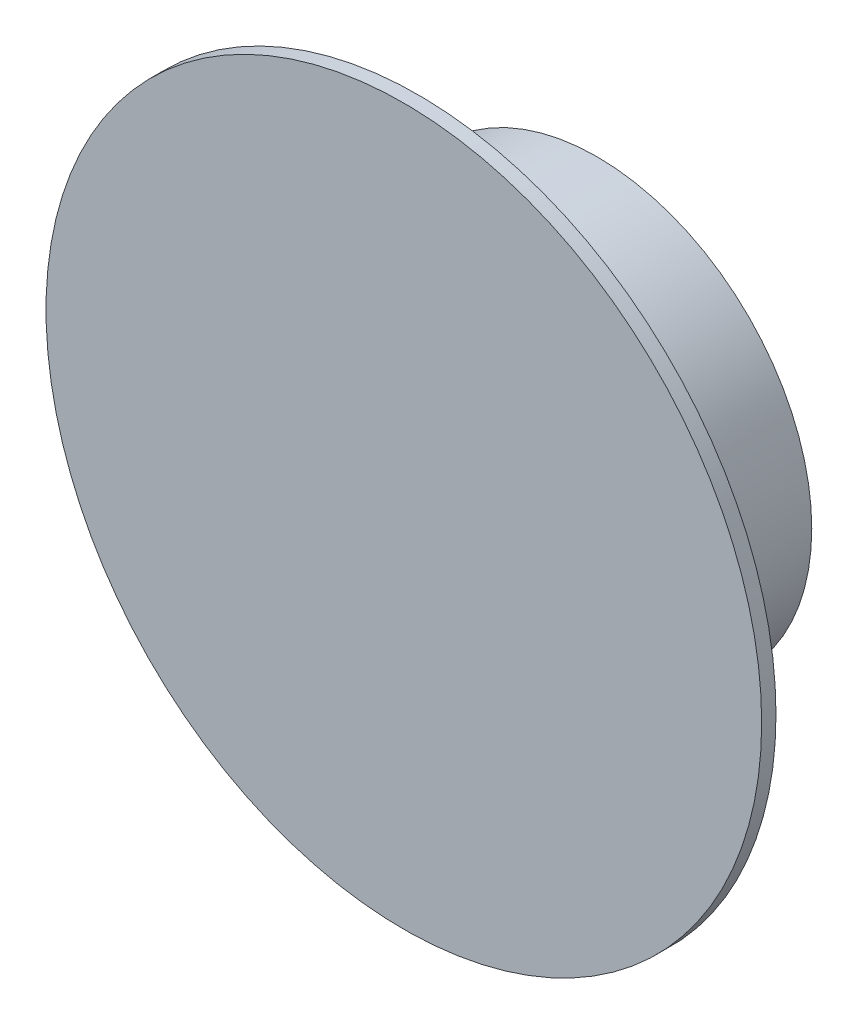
ISO-10303-21;
HEADER;
FILE_DESCRIPTION(('STEP AP214'),'2;1');
FILE_NAME('part.step','',(''),(''),'','','');
FILE_SCHEMA(('AUTOMOTIVE_DESIGN { 1 0 10303 214 1 1 1 1 }'));
ENDSEC;
DATA;
#1=APPLICATION_CONTEXT('core data for automotive mechanical design processes');
#2=APPLICATION_PROTOCOL_DEFINITION('international standard','automotive_design',2000,#1);
#3=PRODUCT_CONTEXT('',#1,'mechanical');
#4=PRODUCT('Part','Part','',(#3));
#5=PRODUCT_RELATED_PRODUCT_CATEGORY('part','',(#4));
#6=PRODUCT_DEFINITION_FORMATION('','',#4);
#7=PRODUCT_DEFINITION_CONTEXT('part definition',#1,'design');
#8=PRODUCT_DEFINITION('design','',#6,#7);
#9=PRODUCT_DEFINITION_SHAPE('','',#8);
#10=(LENGTH_UNIT() NAMED_UNIT(*) SI_UNIT(.MILLI.,.METRE.));
#11=(NAMED_UNIT(*) PLANE_ANGLE_UNIT() SI_UNIT($,.RADIAN.));
#12=(NAMED_UNIT(*) SI_UNIT($,.STERADIAN.) SOLID_ANGLE_UNIT());
#13=UNCERTAINTY_MEASURE_WITH_UNIT(LENGTH_MEASURE(1.E-05),#10,'distance_accuracy_value','');
#14=(GEOMETRIC_REPRESENTATION_CONTEXT(3) GLOBAL_UNCERTAINTY_ASSIGNED_CONTEXT((#13)) GLOBAL_UNIT_ASSIGNED_CONTEXT((#10,
#11,#12)) REPRESENTATION_CONTEXT('',''));
#15=CARTESIAN_POINT('',(0.,0.,0.));
#16=DIRECTION('',(0.,0.,1.));
#17=DIRECTION('',(1.,0.,0.));
#18=AXIS2_PLACEMENT_3D('',#15,#16,#17);
#19=CARTESIAN_POINT('',(0.,0.,27.));
#20=DIRECTION('',(0.,0.,-1.));
#21=DIRECTION('',(-1.,0.,0.));
#22=AXIS2_PLACEMENT_3D('',#19,#20,#21);
#23=CYLINDRICAL_SURFACE('',#22,50.);
#24=CARTESIAN_POINT('',(0.,0.,27.));
#25=DIRECTION('',(0.,0.,1.));
#26=DIRECTION('',(1.,0.,0.));
#27=AXIS2_PLACEMENT_3D('',#24,#25,#26);
#28=CIRCLE('',#27,50.);
#29=CARTESIAN_POINT('',(50.,0.,27.));
#30=VERTEX_POINT('',#29);
#31=EDGE_CURVE('E11',#30,#30,#28,.T.);
#32=ORIENTED_EDGE('',*,*,#31,.F.);
#33=EDGE_LOOP('',(#32));
#34=FACE_BOUND('',#33,.T.);
#35=CARTESIAN_POINT('',(0.,0.,25.));
#36=DIRECTION('',(0.,0.,1.));
#37=DIRECTION('',(1.,0.,0.));
#38=AXIS2_PLACEMENT_3D('',#35,#36,#37);
#39=CIRCLE('',#38,50.);
#40=CARTESIAN_POINT('',(50.,0.,25.));
#41=VERTEX_POINT('',#40);
#42=EDGE_CURVE('E44',#41,#41,#39,.T.);
#43=ORIENTED_EDGE('',*,*,#42,.T.);
#44=EDGE_LOOP('',(#43));
#45=FACE_BOUND('',#44,.T.);
#46=ADVANCED_FACE('F41',(#34,#45),#23,.T.);
#47=CARTESIAN_POINT('',(0.,0.,27.));
#48=DIRECTION('',(0.,0.,1.));
#49=DIRECTION('',(1.,0.,0.));
#50=AXIS2_PLACEMENT_3D('',#47,#48,#49);
#51=PLANE('',#50);
#52=ORIENTED_EDGE('',*,*,#31,.T.);
#53=EDGE_LOOP('',(#52));
#54=FACE_BOUND('',#53,.T.);
#55=ADVANCED_FACE('F56',(#54),#51,.T.);
#56=CARTESIAN_POINT('',(0.,0.,25.));
#57=DIRECTION('',(0.,0.,1.));
#58=DIRECTION('',(1.,0.,0.));
#59=AXIS2_PLACEMENT_3D('',#56,#57,#58);
#60=PLANE('',#59);
#61=ORIENTED_EDGE('',*,*,#42,.F.);
#62=EDGE_LOOP('',(#61));
#63=FACE_BOUND('',#62,.T.);
#64=ADVANCED_FACE('F54',(#63),#60,.F.);
#65=CLOSED_SHELL('',(#46,#55,#64));
#66=MANIFOLD_SOLID_BREP('B2',#65);
#67=CARTESIAN_POINT('',(0.,0.,25.));
#68=DIRECTION('',(0.,0.,-1.));
#69=DIRECTION('',(-1.,0.,0.));
#70=AXIS2_PLACEMENT_3D('',#67,#68,#69);
#71=CYLINDRICAL_SURFACE('',#70,30.);
#72=CARTESIAN_POINT('',(0.,0.,23.));
#73=DIRECTION('',(0.,0.,1.));
#74=DIRECTION('',(1.,0.,0.));
#75=AXIS2_PLACEMENT_3D('',#72,#73,#74);
#76=CIRCLE('',#75,30.);
#77=CARTESIAN_POINT('',(30.,0.,23.));
#78=VERTEX_POINT('',#77);
#79=EDGE_CURVE('E40',#78,#78,#76,.F.);
#80=ORIENTED_EDGE('',*,*,#79,.T.);
#81=EDGE_LOOP('',(#80));
#82=FACE_BOUND('',#81,.T.);
#83=CARTESIAN_POINT('',(0.,0.,0.));
#84=DIRECTION('',(0.,0.,1.));
#85=DIRECTION('',(1.,0.,0.));
#86=AXIS2_PLACEMENT_3D('',#83,#84,#85);
#87=CIRCLE('',#86,30.);
#88=CARTESIAN_POINT('',(30.,0.,0.));
#89=VERTEX_POINT('',#88);
#90=EDGE_CURVE('E92',#89,#89,#87,.T.);
#91=ORIENTED_EDGE('',*,*,#90,.T.);
#92=EDGE_LOOP('',(#91));
#93=FACE_BOUND('',#92,.T.);
#94=ADVANCED_FACE('F81',(#82,#93),#71,.T.);
#95=CARTESIAN_POINT('',(0.,0.,25.));
#96=DIRECTION('',(0.,0.,1.));
#97=DIRECTION('',(1.,0.,0.));
#98=AXIS2_PLACEMENT_3D('',#95,#96,#97);
#99=PLANE('',#98);
#100=CARTESIAN_POINT('',(0.,0.,25.));
#101=DIRECTION('',(0.,0.,1.));
#102=DIRECTION('',(1.,0.,0.));
#103=AXIS2_PLACEMENT_3D('',#100,#101,#102);
#104=CIRCLE('',#103,28.);
#105=CARTESIAN_POINT('',(28.,0.,25.));
#106=VERTEX_POINT('',#105);
#107=EDGE_CURVE('E88',#106,#106,#104,.T.);
#108=ORIENTED_EDGE('',*,*,#107,.T.);
#109=EDGE_LOOP('',(#108));
#110=FACE_BOUND('',#109,.T.);
#111=ADVANCED_FACE('F121',(#110),#99,.T.);
#112=CARTESIAN_POINT('',(0.,0.,0.));
#113=DIRECTION('',(0.,0.,1.));
#114=DIRECTION('',(1.,0.,0.));
#115=AXIS2_PLACEMENT_3D('',#112,#113,#114);
#116=PLANE('',#115);
#117=CARTESIAN_POINT('',(0.,0.,0.));
#118=DIRECTION('',(0.,0.,1.));
#119=DIRECTION('',(1.,0.,0.));
#120=AXIS2_PLACEMENT_3D('',#117,#118,#119);
#121=CIRCLE('',#120,28.5);
#122=CARTESIAN_POINT('',(28.5,0.,0.));
#123=VERTEX_POINT('',#122);
#124=EDGE_CURVE('E99',#123,#123,#121,.T.);
#125=ORIENTED_EDGE('',*,*,#124,.T.);
#126=EDGE_LOOP('',(#125));
#127=FACE_BOUND('',#126,.T.);
#128=ORIENTED_EDGE('',*,*,#90,.F.);
#129=EDGE_LOOP('',(#128));
#130=FACE_BOUND('',#129,.T.);
#131=ADVANCED_FACE('F118',(#127,#130),#116,.F.);
#132=CARTESIAN_POINT('',(0.,0.,23.));
#133=DIRECTION('',(0.,0.,1.));
#134=DIRECTION('',(1.,0.,0.));
#135=AXIS2_PLACEMENT_3D('',#132,#133,#134);
#136=TOROIDAL_SURFACE('',#135,28.,2.);
#137=ORIENTED_EDGE('',*,*,#79,.F.);
#138=EDGE_LOOP('',(#137));
#139=FACE_BOUND('',#138,.T.);
#140=ORIENTED_EDGE('',*,*,#107,.F.);
#141=EDGE_LOOP('',(#140));
#142=FACE_BOUND('',#141,.T.);
#143=ADVANCED_FACE('F83',(#139,#142),#136,.T.);
#144=CARTESIAN_POINT('',(0.,0.,25.));
#145=DIRECTION('',(0.,0.,-1.));
#146=DIRECTION('',(-1.,0.,0.));
#147=AXIS2_PLACEMENT_3D('',#144,#145,#146);
#148=CYLINDRICAL_SURFACE('',#147,28.5);
#149=CARTESIAN_POINT('',(0.,0.,23.));
#150=DIRECTION('',(0.,0.,-1.));
#151=DIRECTION('',(-1.,0.,0.));
#152=AXIS2_PLACEMENT_3D('',#149,#150,#151);
#153=CIRCLE('',#152,28.5);
#154=CARTESIAN_POINT('',(-28.5,0.,23.));
#155=VERTEX_POINT('',#154);
#156=EDGE_CURVE('E96',#155,#155,#153,.T.);
#157=ORIENTED_EDGE('',*,*,#156,.F.);
#158=EDGE_LOOP('',(#157));
#159=FACE_BOUND('',#158,.T.);
#160=ORIENTED_EDGE('',*,*,#124,.F.);
#161=EDGE_LOOP('',(#160));
#162=FACE_BOUND('',#161,.T.);
#163=ADVANCED_FACE('F111',(#159,#162),#148,.F.);
#164=CARTESIAN_POINT('',(0.,0.,23.5));
#165=DIRECTION('',(0.,0.,1.));
#166=DIRECTION('',(1.,0.,0.));
#167=AXIS2_PLACEMENT_3D('',#164,#165,#166);
#168=PLANE('',#167);
#169=CARTESIAN_POINT('',(0.,0.,23.5));
#170=DIRECTION('',(0.,0.,1.));
#171=DIRECTION('',(1.,0.,0.));
#172=AXIS2_PLACEMENT_3D('',#169,#170,#171);
#173=CIRCLE('',#172,28.);
#174=CARTESIAN_POINT('',(28.,0.,23.5));
#175=VERTEX_POINT('',#174);
#176=EDGE_CURVE('E102',#175,#175,#173,.T.);
#177=ORIENTED_EDGE('',*,*,#176,.F.);
#178=EDGE_LOOP('',(#177));
#179=FACE_BOUND('',#178,.T.);
#180=ADVANCED_FACE('F114',(#179),#168,.F.);
#181=CARTESIAN_POINT('',(0.,0.,23.));
#182=DIRECTION('',(0.,0.,1.));
#183=DIRECTION('',(1.,0.,0.));
#184=AXIS2_PLACEMENT_3D('',#181,#182,#183);
#185=TOROIDAL_SURFACE('',#184,28.,0.5);
#186=ORIENTED_EDGE('',*,*,#156,.T.);
#187=EDGE_LOOP('',(#186));
#188=FACE_BOUND('',#187,.T.);
#189=ORIENTED_EDGE('',*,*,#176,.T.);
#190=EDGE_LOOP('',(#189));
#191=FACE_BOUND('',#190,.T.);
#192=ADVANCED_FACE('F108',(#188,#191),#185,.F.);
#193=CLOSED_SHELL('',(#94,#111,#131,#143,#163,#180,#192));
#194=MANIFOLD_SOLID_BREP('B6',#193);
#195=ADVANCED_BREP_SHAPE_REPRESENTATION('',(#18,#66,#194),#14);
#196=SHAPE_DEFINITION_REPRESENTATION(#9,#195);
ENDSEC;
END-ISO-10303-21;
